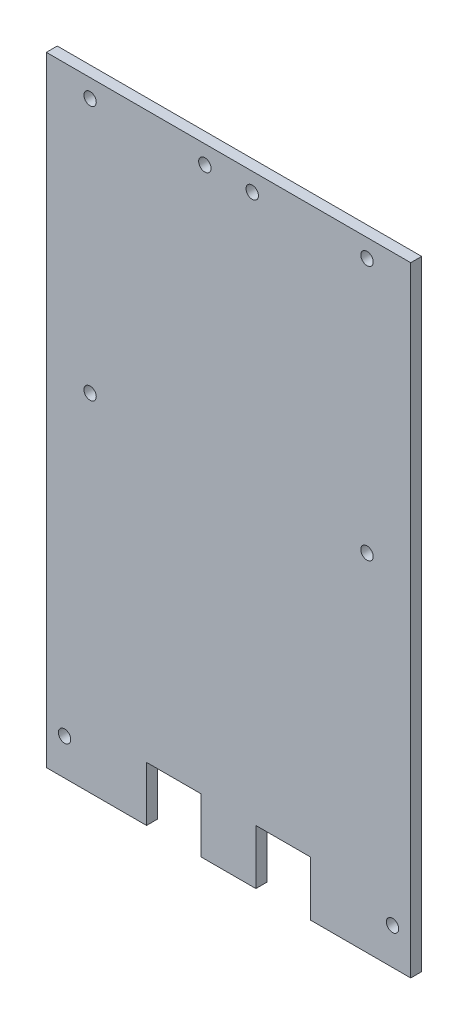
from build123d import *

# Parameters (mm, degrees)
SKETCH_1_W              = 100
SKETCH_1_H              = 170
EXTRUDE_1_DEPTH         = 3
SKETCH_2_W              = 15
SKETCH_2_H              = 30
CUT_EXTRUDE_1_DEPTH     = 3
HOLE_WIZARD_3_4_3_4_1_D = 3.4
HOLE_WIZARD_3_4_3_4_2_D = 3.4
HOLE_WIZARD_3_4_3_4_3_D = 3.4


with BuildPart() as part:
    # Sketch 1 → Extrude 1 (new body)
    with BuildSketch(Plane.XY):
        Rectangle(SKETCH_1_W, SKETCH_1_H)
    extrude(amount=EXTRUDE_1_DEPTH)

    # Sketch 2 → Cut-Extrude 1 (cut)
    with BuildSketch(Plane.XY.offset(3)):
        with Locations((-15, -85)):
            Rectangle(SKETCH_2_W, SKETCH_2_H)
        with Locations((15, -85)):
            Rectangle(SKETCH_2_W, SKETCH_2_H)
    extrude(amount=-CUT_EXTRUDE_1_DEPTH, mode=Mode.SUBTRACT)

    # Hole Wizard 3.4 _3.4_ _1 (through all)
    with Locations(Plane.XY.offset(3)):
        with Locations((-6.5, 80), (6.5, 80)):
            Hole(HOLE_WIZARD_3_4_3_4_1_D / 2)

    # Hole Wizard 3.4 _3.4_ _2 (through all)
    with Locations(Plane.XY.offset(3)):
        with Locations((-45, -75), (45, -75)):
            Hole(HOLE_WIZARD_3_4_3_4_2_D / 2)

    # Hole Wizard 3.4 _3.4_ _3 (through all)
    with Locations(Plane.XY.offset(3)):
        with Locations((-38, 80), (38, 80), (-38, 10), (38, 10)):
            Hole(HOLE_WIZARD_3_4_3_4_3_D / 2)


solid = part.part
